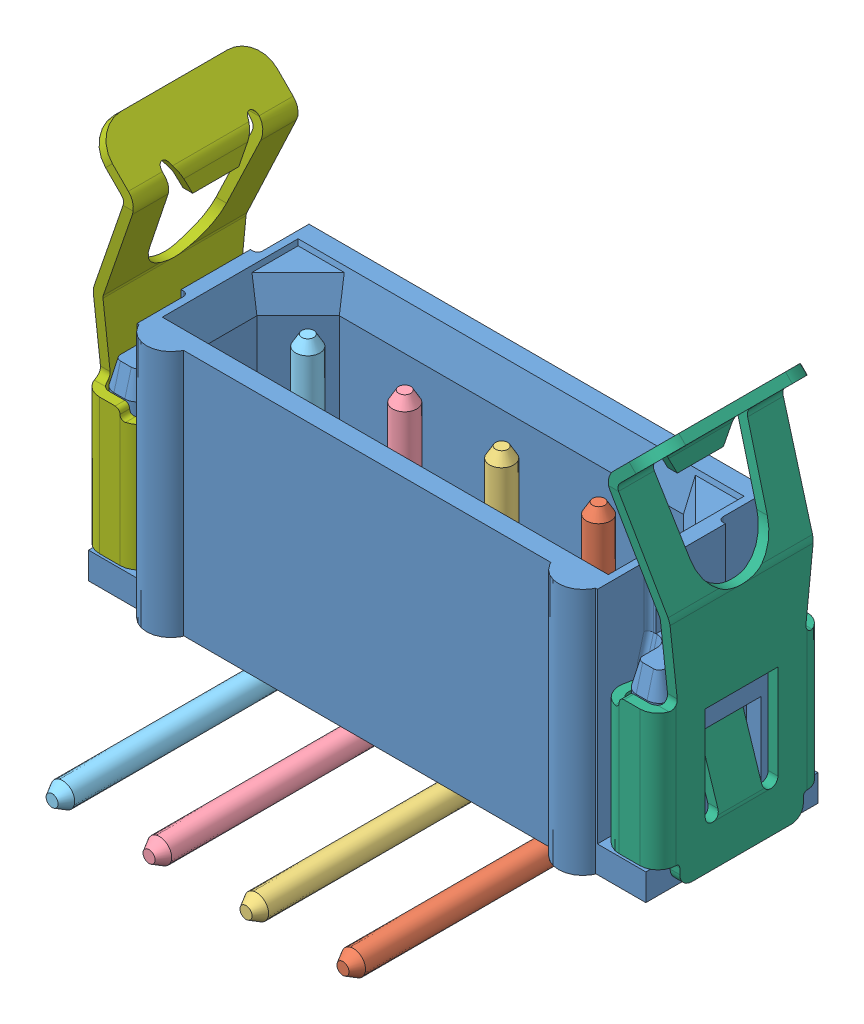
SolidWorks assembly m80-8420442_asm.sldasm, configuration Default (file format 6000). Lengths in mm.
Overall size (11.9 9.1 7.05).
8 component instances, 7 part files, 0 mates.
Components (placement in the parent):
- M80-8780422-1: M80-8780422.sldasm [Default] at origin size (11.5 6.15 7.05)
  - M80-1000498-1: M80-1000498.sldprt [Default] at origin size (11.5 5.4 3.85)
  - M80-878-PIN_2-1: M80-878-PIN_2.sldprt [Default] at origin size (0.8 5.95 5.68)
  - M80-878-PIN_1_1-1: M80-878-PIN_1_1.sldprt [Default] at origin size (0.8 5.95 5.68)
  - M80-878-PIN_2-1-1: M80-878-PIN_2-1.sldprt [Default] at origin size (0.8 5.95 5.68)
  - M80-878-PIN_3-1: M80-878-PIN_3.sldprt [Default] at origin size (0.8 5.95 5.68)
- M80-001XXXX_4-1: M80-001XXXX_4.sldprt [Default] at origin size (1.2 7.95 3.45)
- M80-001XXXX_1_3-1: M80-001XXXX_1_3.sldprt [Default] at origin size (1.2 7.95 3.45)
